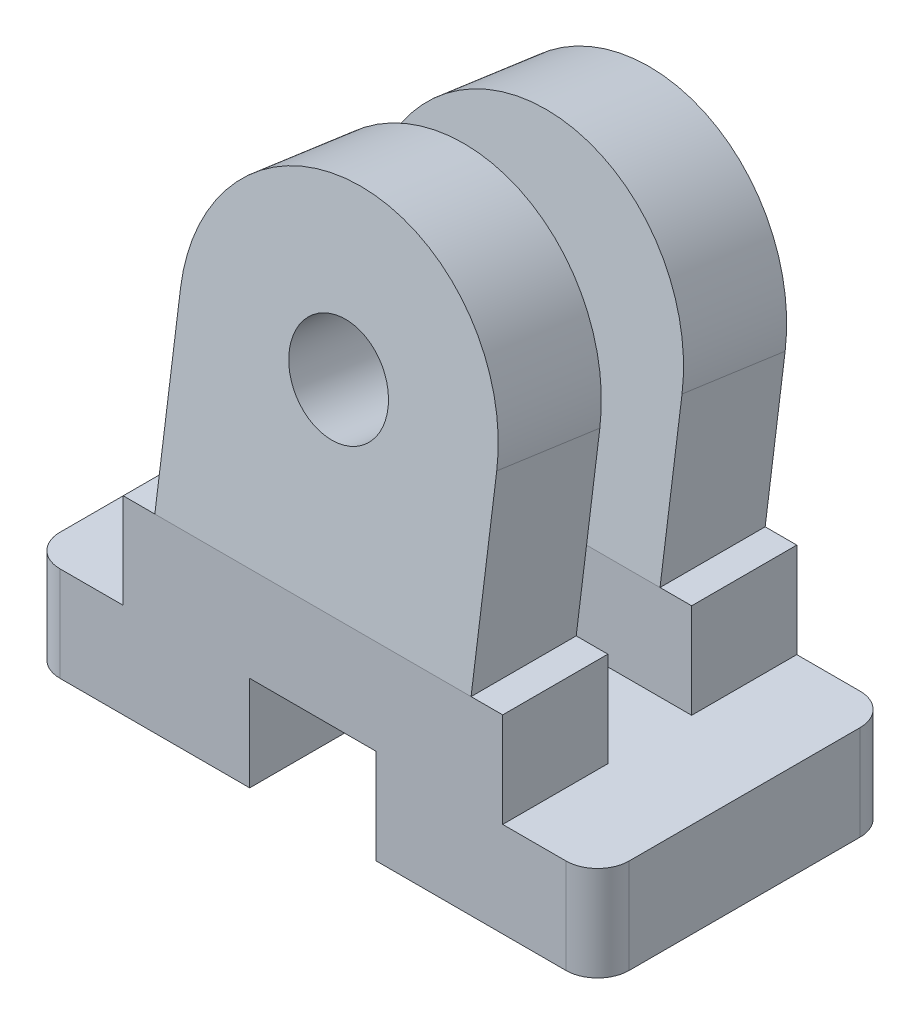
from build123d import *

# Parameters (mm, degrees)
SKETCH1_W              = 18
SKETCH1_H              = 9.3
BASE_DEPTH             = 3
SKETCH2_W              = 12
SKETCH2_H              = 3.325
BASE_MID_DEPTH         = 3
PULLEY_HEAD_DEPTH      = 5
PULLEY_HEAD_DEPTH_BACK = 5
SKETCH4_R              = 1.5625
FRAME_DEPTH            = 22.567471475
SKETCH5_W              = 4
SKETCH5_H              = 9.3
BASE_SLOT_DEPTH        = 3
CORNER_ALLOWANCES_R    = 1


with BuildPart() as part:
    # Sketch1 → Base (new body)
    with BuildSketch(Plane(origin=(0, 0, 0), x_dir=(1, 0, 0), z_dir=(0, 1, 0))):
        Rectangle(SKETCH1_W, SKETCH1_H)
    extrude(amount=BASE_DEPTH)

    # Sketch2 → Base Mid (add)
    with BuildSketch(Plane(origin=(0, 3, 0), x_dir=(1, 0, 0), z_dir=(0, 1, 0))):
        with Locations((0, 2.9875)):
            Rectangle(SKETCH2_W, SKETCH2_H)
        with Locations((0, -2.9875)):
            Rectangle(SKETCH2_W, SKETCH2_H)
    extrude(amount=BASE_MID_DEPTH)

    # Sketch3 → Pulley Head (add, two sides: drawn at the far end of the back side and taken through both)
    with BuildSketch(Plane(origin=(0, 0, 0), x_dir=(0, 0, -1), z_dir=(1, 0, 0)).offset(-PULLEY_HEAD_DEPTH_BACK)):
        Polygon((-3.142538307, 16.726147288), (-4.65, 6), (-1.325, 6), (0.118059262, 16.267900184), align=None)
        Polygon((2.71673101, 15.902680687), (1.325, 6), (4.65, 6), (5.977328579, 15.444433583), align=None)
    extrude(amount=PULLEY_HEAD_DEPTH + PULLEY_HEAD_DEPTH_BACK)

    # Sketch4 → Frame (cut, through all)
    with BuildSketch(Plane(origin=(0, 0.757071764, 5.386845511), x_dir=(1, 0, 0), z_dir=(0, 0.1391731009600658, 0.9902680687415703))):
        with Locations(Location((0, 11.126012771, 0), (0, 0, 270))):
            Circle(SKETCH4_R)
        with BuildLine():
            Line((-5, 11.126012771), (-5, 17.418724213))
            Line((-5, 17.418724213), (5, 17.418724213))
            Line((5, 17.418724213), (5, 11.126012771))
            ThreePointArc((5, 11.126012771), (0, 16.126012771), (-5, 11.126012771))
        make_face()
    extrude(amount=-FRAME_DEPTH, mode=Mode.SUBTRACT)

    # Sketch5 → Base Slot (cut)
    with BuildSketch(Plane.XZ):
        Rectangle(SKETCH5_W, SKETCH5_H)
    extrude(amount=-BASE_SLOT_DEPTH, mode=Mode.SUBTRACT)

    # Corner Allowances
    corner_allowances_edges = [part.edges().sort_by_distance(p)[0] for p in [
        (-9, 1.5, -4.65),
        (-9, 1.5, 4.65),
        (9, 1.5, -4.65),
        (9, 1.5, 4.65),
    ]]
    fillet(corner_allowances_edges, radius=CORNER_ALLOWANCES_R)


solid = part.part
